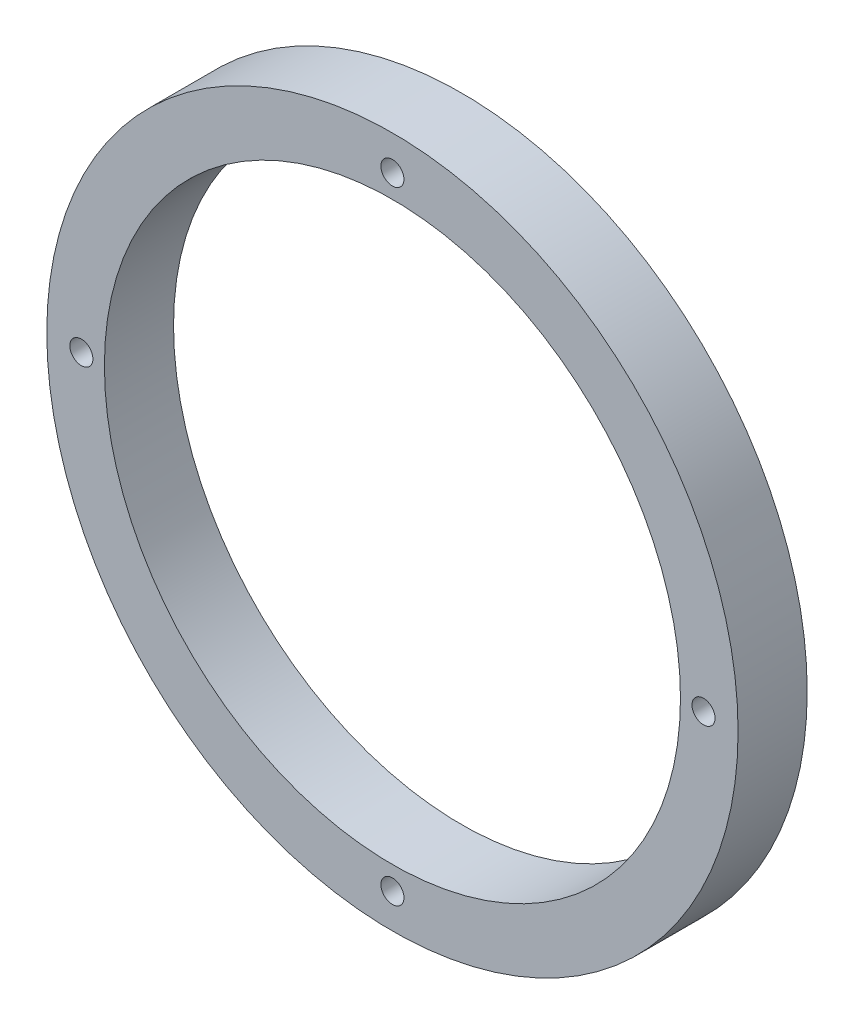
ISO-10303-21;
HEADER;
FILE_DESCRIPTION(('STEP AP214'),'2;1');
FILE_NAME('part.step','',(''),(''),'','','');
FILE_SCHEMA(('AUTOMOTIVE_DESIGN { 1 0 10303 214 1 1 1 1 }'));
ENDSEC;
DATA;
#1=APPLICATION_CONTEXT('core data for automotive mechanical design processes');
#2=APPLICATION_PROTOCOL_DEFINITION('international standard','automotive_design',2000,#1);
#3=PRODUCT_CONTEXT('',#1,'mechanical');
#4=PRODUCT('Part','Part','',(#3));
#5=PRODUCT_RELATED_PRODUCT_CATEGORY('part','',(#4));
#6=PRODUCT_DEFINITION_FORMATION('','',#4);
#7=PRODUCT_DEFINITION_CONTEXT('part definition',#1,'design');
#8=PRODUCT_DEFINITION('design','',#6,#7);
#9=PRODUCT_DEFINITION_SHAPE('','',#8);
#10=(LENGTH_UNIT() NAMED_UNIT(*) SI_UNIT(.MILLI.,.METRE.));
#11=(NAMED_UNIT(*) PLANE_ANGLE_UNIT() SI_UNIT($,.RADIAN.));
#12=(NAMED_UNIT(*) SI_UNIT($,.STERADIAN.) SOLID_ANGLE_UNIT());
#13=UNCERTAINTY_MEASURE_WITH_UNIT(LENGTH_MEASURE(1.E-05),#10,'distance_accuracy_value','');
#14=(GEOMETRIC_REPRESENTATION_CONTEXT(3) GLOBAL_UNCERTAINTY_ASSIGNED_CONTEXT((#13)) GLOBAL_UNIT_ASSIGNED_CONTEXT((#10,
#11,#12)) REPRESENTATION_CONTEXT('',''));
#15=CARTESIAN_POINT('',(0.,0.,0.));
#16=DIRECTION('',(0.,0.,1.));
#17=DIRECTION('',(1.,0.,0.));
#18=AXIS2_PLACEMENT_3D('',#15,#16,#17);
#19=CARTESIAN_POINT('',(0.,0.,3.));
#20=DIRECTION('',(0.,0.,1.));
#21=DIRECTION('',(1.,0.,0.));
#22=AXIS2_PLACEMENT_3D('',#19,#20,#21);
#23=PLANE('',#22);
#24=CARTESIAN_POINT('',(-13.5,1.4140507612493E-13,3.));
#25=DIRECTION('',(0.,0.,1.));
#26=DIRECTION('',(0.,1.,0.));
#27=AXIS2_PLACEMENT_3D('',#24,#25,#26);
#28=CIRCLE('',#27,0.5);
#29=CARTESIAN_POINT('',(-13.5,0.500000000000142,3.));
#30=VERTEX_POINT('',#29);
#31=EDGE_CURVE('E68',#30,#30,#28,.T.);
#32=ORIENTED_EDGE('',*,*,#31,.F.);
#33=EDGE_LOOP('',(#32));
#34=FACE_BOUND('',#33,.T.);
#35=CARTESIAN_POINT('',(0.,-13.5,3.));
#36=DIRECTION('',(0.,0.,1.));
#37=DIRECTION('',(-1.,0.,0.));
#38=AXIS2_PLACEMENT_3D('',#35,#36,#37);
#39=CIRCLE('',#38,0.5);
#40=CARTESIAN_POINT('',(-0.500000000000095,-13.5,3.));
#41=VERTEX_POINT('',#40);
#42=EDGE_CURVE('E62',#41,#41,#39,.T.);
#43=ORIENTED_EDGE('',*,*,#42,.F.);
#44=EDGE_LOOP('',(#43));
#45=FACE_BOUND('',#44,.T.);
#46=CARTESIAN_POINT('',(13.5,0.,3.));
#47=DIRECTION('',(0.,0.,1.));
#48=DIRECTION('',(0.,-1.,0.));
#49=AXIS2_PLACEMENT_3D('',#46,#47,#48);
#50=CIRCLE('',#49,0.5);
#51=CARTESIAN_POINT('',(13.5,-0.500000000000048,3.));
#52=VERTEX_POINT('',#51);
#53=EDGE_CURVE('E56',#52,#52,#50,.T.);
#54=ORIENTED_EDGE('',*,*,#53,.F.);
#55=EDGE_LOOP('',(#54));
#56=FACE_BOUND('',#55,.T.);
#57=CARTESIAN_POINT('',(0.,13.5,3.));
#58=DIRECTION('',(0.,0.,1.));
#59=DIRECTION('',(1.,0.,0.));
#60=AXIS2_PLACEMENT_3D('',#57,#58,#59);
#61=CIRCLE('',#60,0.5);
#62=CARTESIAN_POINT('',(0.5,13.5,3.));
#63=VERTEX_POINT('',#62);
#64=EDGE_CURVE('E50',#63,#63,#61,.T.);
#65=ORIENTED_EDGE('',*,*,#64,.F.);
#66=EDGE_LOOP('',(#65));
#67=FACE_BOUND('',#66,.T.);
#68=CARTESIAN_POINT('',(0.,0.,3.));
#69=DIRECTION('',(0.,0.,1.));
#70=DIRECTION('',(1.,0.,0.));
#71=AXIS2_PLACEMENT_3D('',#68,#69,#70);
#72=CIRCLE('',#71,15.);
#73=CARTESIAN_POINT('',(15.,0.,3.));
#74=VERTEX_POINT('',#73);
#75=EDGE_CURVE('E10',#74,#74,#72,.T.);
#76=ORIENTED_EDGE('',*,*,#75,.T.);
#77=EDGE_LOOP('',(#76));
#78=FACE_BOUND('',#77,.T.);
#79=CARTESIAN_POINT('',(0.,0.,3.));
#80=DIRECTION('',(0.,0.,1.));
#81=DIRECTION('',(1.,0.,0.));
#82=AXIS2_PLACEMENT_3D('',#79,#80,#81);
#83=CIRCLE('',#82,12.5);
#84=CARTESIAN_POINT('',(12.5,0.,3.));
#85=VERTEX_POINT('',#84);
#86=EDGE_CURVE('E42',#85,#85,#83,.T.);
#87=ORIENTED_EDGE('',*,*,#86,.F.);
#88=EDGE_LOOP('',(#87));
#89=FACE_BOUND('',#88,.T.);
#90=ADVANCED_FACE('F31',(#34,#45,#56,#67,#78,#89),#23,.T.);
#91=CARTESIAN_POINT('',(0.,0.,0.));
#92=DIRECTION('',(0.,0.,1.));
#93=DIRECTION('',(1.,0.,0.));
#94=AXIS2_PLACEMENT_3D('',#91,#92,#93);
#95=PLANE('',#94);
#96=CARTESIAN_POINT('',(-13.5,1.4140507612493E-13,0.));
#97=DIRECTION('',(0.,0.,1.));
#98=DIRECTION('',(0.,1.,0.));
#99=AXIS2_PLACEMENT_3D('',#96,#97,#98);
#100=CIRCLE('',#99,0.5);
#101=CARTESIAN_POINT('',(-13.5,0.500000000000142,0.));
#102=VERTEX_POINT('',#101);
#103=EDGE_CURVE('E65',#102,#102,#100,.T.);
#104=ORIENTED_EDGE('',*,*,#103,.T.);
#105=EDGE_LOOP('',(#104));
#106=FACE_BOUND('',#105,.T.);
#107=CARTESIAN_POINT('',(0.,-13.5,0.));
#108=DIRECTION('',(0.,0.,1.));
#109=DIRECTION('',(-1.,0.,0.));
#110=AXIS2_PLACEMENT_3D('',#107,#108,#109);
#111=CIRCLE('',#110,0.5);
#112=CARTESIAN_POINT('',(-0.500000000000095,-13.5,0.));
#113=VERTEX_POINT('',#112);
#114=EDGE_CURVE('E59',#113,#113,#111,.T.);
#115=ORIENTED_EDGE('',*,*,#114,.T.);
#116=EDGE_LOOP('',(#115));
#117=FACE_BOUND('',#116,.T.);
#118=CARTESIAN_POINT('',(13.5,0.,0.));
#119=DIRECTION('',(0.,0.,1.));
#120=DIRECTION('',(0.,-1.,0.));
#121=AXIS2_PLACEMENT_3D('',#118,#119,#120);
#122=CIRCLE('',#121,0.5);
#123=CARTESIAN_POINT('',(13.5,-0.500000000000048,0.));
#124=VERTEX_POINT('',#123);
#125=EDGE_CURVE('E53',#124,#124,#122,.T.);
#126=ORIENTED_EDGE('',*,*,#125,.T.);
#127=EDGE_LOOP('',(#126));
#128=FACE_BOUND('',#127,.T.);
#129=CARTESIAN_POINT('',(0.,13.5,0.));
#130=DIRECTION('',(0.,0.,1.));
#131=DIRECTION('',(1.,0.,0.));
#132=AXIS2_PLACEMENT_3D('',#129,#130,#131);
#133=CIRCLE('',#132,0.5);
#134=CARTESIAN_POINT('',(0.5,13.5,0.));
#135=VERTEX_POINT('',#134);
#136=EDGE_CURVE('E47',#135,#135,#133,.T.);
#137=ORIENTED_EDGE('',*,*,#136,.T.);
#138=EDGE_LOOP('',(#137));
#139=FACE_BOUND('',#138,.T.);
#140=CARTESIAN_POINT('',(0.,0.,0.));
#141=DIRECTION('',(0.,0.,1.));
#142=DIRECTION('',(1.,0.,0.));
#143=AXIS2_PLACEMENT_3D('',#140,#141,#142);
#144=CIRCLE('',#143,15.);
#145=CARTESIAN_POINT('',(15.,0.,0.));
#146=VERTEX_POINT('',#145);
#147=EDGE_CURVE('E35',#146,#146,#144,.T.);
#148=ORIENTED_EDGE('',*,*,#147,.F.);
#149=EDGE_LOOP('',(#148));
#150=FACE_BOUND('',#149,.T.);
#151=CARTESIAN_POINT('',(0.,0.,0.));
#152=DIRECTION('',(0.,0.,1.));
#153=DIRECTION('',(1.,0.,0.));
#154=AXIS2_PLACEMENT_3D('',#151,#152,#153);
#155=CIRCLE('',#154,12.5);
#156=CARTESIAN_POINT('',(12.5,0.,0.));
#157=VERTEX_POINT('',#156);
#158=EDGE_CURVE('E44',#157,#157,#155,.T.);
#159=ORIENTED_EDGE('',*,*,#158,.T.);
#160=EDGE_LOOP('',(#159));
#161=FACE_BOUND('',#160,.T.);
#162=ADVANCED_FACE('F74',(#106,#117,#128,#139,#150,#161),#95,.F.);
#163=CARTESIAN_POINT('',(0.,0.,3.));
#164=DIRECTION('',(0.,0.,-1.));
#165=DIRECTION('',(-1.,0.,0.));
#166=AXIS2_PLACEMENT_3D('',#163,#164,#165);
#167=CYLINDRICAL_SURFACE('',#166,15.);
#168=ORIENTED_EDGE('',*,*,#75,.F.);
#169=EDGE_LOOP('',(#168));
#170=FACE_BOUND('',#169,.T.);
#171=ORIENTED_EDGE('',*,*,#147,.T.);
#172=EDGE_LOOP('',(#171));
#173=FACE_BOUND('',#172,.T.);
#174=ADVANCED_FACE('F33',(#170,#173),#167,.T.);
#175=CARTESIAN_POINT('',(0.,0.,3.));
#176=DIRECTION('',(0.,0.,-1.));
#177=DIRECTION('',(-1.,0.,0.));
#178=AXIS2_PLACEMENT_3D('',#175,#176,#177);
#179=CYLINDRICAL_SURFACE('',#178,12.5);
#180=ORIENTED_EDGE('',*,*,#86,.T.);
#181=EDGE_LOOP('',(#180));
#182=FACE_BOUND('',#181,.T.);
#183=ORIENTED_EDGE('',*,*,#158,.F.);
#184=EDGE_LOOP('',(#183));
#185=FACE_BOUND('',#184,.T.);
#186=ADVANCED_FACE('F95',(#182,#185),#179,.F.);
#187=CARTESIAN_POINT('',(0.,13.5,0.));
#188=DIRECTION('',(0.,0.,1.));
#189=DIRECTION('',(1.,0.,0.));
#190=AXIS2_PLACEMENT_3D('',#187,#188,#189);
#191=CYLINDRICAL_SURFACE('',#190,0.5);
#192=ORIENTED_EDGE('',*,*,#136,.F.);
#193=EDGE_LOOP('',(#192));
#194=FACE_BOUND('',#193,.T.);
#195=ORIENTED_EDGE('',*,*,#64,.T.);
#196=EDGE_LOOP('',(#195));
#197=FACE_BOUND('',#196,.T.);
#198=ADVANCED_FACE('F98',(#194,#197),#191,.F.);
#199=CARTESIAN_POINT('',(13.5,0.,0.));
#200=DIRECTION('',(0.,0.,1.));
#201=DIRECTION('',(1.,0.,0.));
#202=AXIS2_PLACEMENT_3D('',#199,#200,#201);
#203=CYLINDRICAL_SURFACE('',#202,0.5);
#204=ORIENTED_EDGE('',*,*,#125,.F.);
#205=EDGE_LOOP('',(#204));
#206=FACE_BOUND('',#205,.T.);
#207=ORIENTED_EDGE('',*,*,#53,.T.);
#208=EDGE_LOOP('',(#207));
#209=FACE_BOUND('',#208,.T.);
#210=ADVANCED_FACE('F110',(#206,#209),#203,.F.);
#211=CARTESIAN_POINT('',(0.,-13.5,0.));
#212=DIRECTION('',(0.,0.,1.));
#213=DIRECTION('',(1.,0.,0.));
#214=AXIS2_PLACEMENT_3D('',#211,#212,#213);
#215=CYLINDRICAL_SURFACE('',#214,0.5);
#216=ORIENTED_EDGE('',*,*,#114,.F.);
#217=EDGE_LOOP('',(#216));
#218=FACE_BOUND('',#217,.T.);
#219=ORIENTED_EDGE('',*,*,#42,.T.);
#220=EDGE_LOOP('',(#219));
#221=FACE_BOUND('',#220,.T.);
#222=ADVANCED_FACE('F80',(#218,#221),#215,.F.);
#223=CARTESIAN_POINT('',(-13.5,1.4140507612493E-13,0.));
#224=DIRECTION('',(0.,0.,1.));
#225=DIRECTION('',(1.,0.,0.));
#226=AXIS2_PLACEMENT_3D('',#223,#224,#225);
#227=CYLINDRICAL_SURFACE('',#226,0.5);
#228=ORIENTED_EDGE('',*,*,#103,.F.);
#229=EDGE_LOOP('',(#228));
#230=FACE_BOUND('',#229,.T.);
#231=ORIENTED_EDGE('',*,*,#31,.T.);
#232=EDGE_LOOP('',(#231));
#233=FACE_BOUND('',#232,.T.);
#234=ADVANCED_FACE('F77',(#230,#233),#227,.F.);
#235=CLOSED_SHELL('',(#90,#162,#174,#186,#198,#210,#222,#234));
#236=MANIFOLD_SOLID_BREP('B2',#235);
#237=ADVANCED_BREP_SHAPE_REPRESENTATION('',(#18,#236),#14);
#238=SHAPE_DEFINITION_REPRESENTATION(#9,#237);
ENDSEC;
END-ISO-10303-21;
